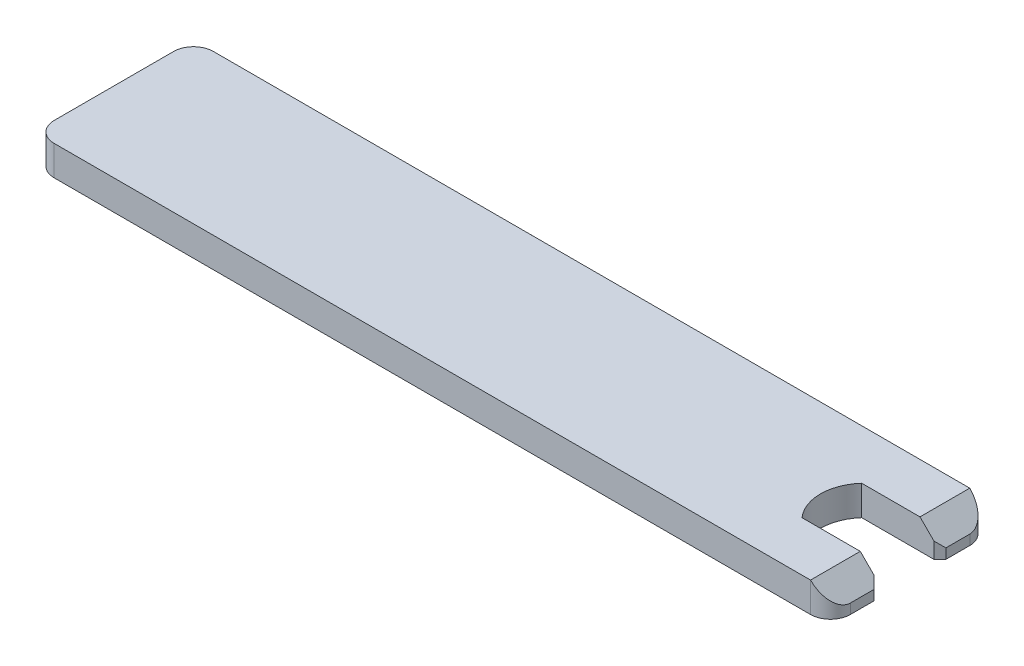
from build123d import *

# Parameters (mm, degrees)
BOSS_EXTRUDE1_DEPTH = 0.75
CHAMFER2_SIZE       = 1
FILLET1_R           = 1
CHAMFER1_SIZE       = 0.3


with BuildPart() as part:
    # Sketch1 → Boss-Extrude1 (new, symmetric)
    with BuildSketch(Plane(origin=(0, 0, 0), x_dir=(1, 0, 0), z_dir=(0, 1, 0))):
        with BuildLine():
            Line((-1.677050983, 1.5), (2.25, 1.5))
            Line((2.25, 1.5), (2.25, 4))
            Line((2.25, 4), (-37.75, 4))
            Line((-37.75, 4), (-37.75, -4))
            Line((-37.75, -4), (2.25, -4))
            Line((2.25, -4), (2.25, -1.5))
            Line((2.25, -1.5), (-1.677050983, -1.5))
            ThreePointArc((-1.677050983, -1.5), (-2.25, 0), (-1.677050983, 1.5))
        make_face()
    extrude(amount=BOSS_EXTRUDE1_DEPTH, both=True)

    # Chamfer2
    chamfer2_edges = [part.edges().sort_by_distance(p)[0] for p in [
        (2.25, 0.75, 2.75),
        (2.25, 0.75, -2.75),
    ]]
    chamfer(chamfer2_edges, length=CHAMFER2_SIZE)

    # Fillet1
    fillet1_edges = [part.edges().sort_by_distance(p)[0] for p in [
        (2.25, -0.5, -4),
        (2.25, -0.5, 4),
        (-37.75, 0, -4),
        (-37.75, 0, 4),
    ]]
    fillet(fillet1_edges, radius=FILLET1_R)

    # Chamfer1
    chamfer1_edges = [part.edges().sort_by_distance(p)[0] for p in [
        (2.25, -0.5, -1.5),
        (2.25, -0.5, 1.5),
    ]]
    chamfer(chamfer1_edges, length=CHAMFER1_SIZE)


solid = part.part
